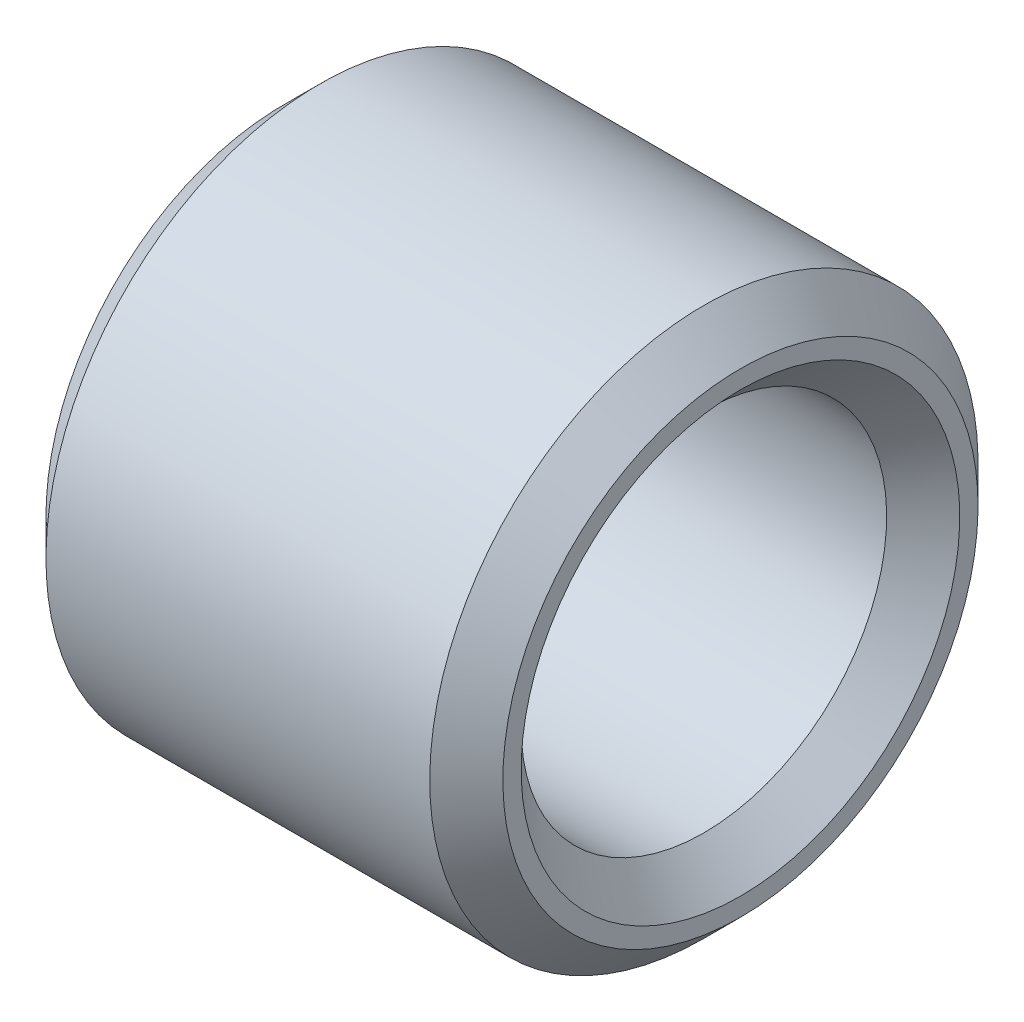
ISO-10303-21;
HEADER;
FILE_DESCRIPTION(('STEP AP214'),'2;1');
FILE_NAME('part.step','',(''),(''),'','','');
FILE_SCHEMA(('AUTOMOTIVE_DESIGN { 1 0 10303 214 1 1 1 1 }'));
ENDSEC;
DATA;
#1=APPLICATION_CONTEXT('core data for automotive mechanical design processes');
#2=APPLICATION_PROTOCOL_DEFINITION('international standard','automotive_design',2000,#1);
#3=PRODUCT_CONTEXT('',#1,'mechanical');
#4=PRODUCT('Part','Part','',(#3));
#5=PRODUCT_RELATED_PRODUCT_CATEGORY('part','',(#4));
#6=PRODUCT_DEFINITION_FORMATION('','',#4);
#7=PRODUCT_DEFINITION_CONTEXT('part definition',#1,'design');
#8=PRODUCT_DEFINITION('design','',#6,#7);
#9=PRODUCT_DEFINITION_SHAPE('','',#8);
#10=(LENGTH_UNIT() NAMED_UNIT(*) SI_UNIT(.MILLI.,.METRE.));
#11=(NAMED_UNIT(*) PLANE_ANGLE_UNIT() SI_UNIT($,.RADIAN.));
#12=(NAMED_UNIT(*) SI_UNIT($,.STERADIAN.) SOLID_ANGLE_UNIT());
#13=UNCERTAINTY_MEASURE_WITH_UNIT(LENGTH_MEASURE(1.E-05),#10,'distance_accuracy_value','');
#14=(GEOMETRIC_REPRESENTATION_CONTEXT(3) GLOBAL_UNCERTAINTY_ASSIGNED_CONTEXT((#13)) GLOBAL_UNIT_ASSIGNED_CONTEXT((#10,
#11,#12)) REPRESENTATION_CONTEXT('',''));
#15=CARTESIAN_POINT('',(0.,0.,0.));
#16=DIRECTION('',(0.,0.,1.));
#17=DIRECTION('',(1.,0.,0.));
#18=AXIS2_PLACEMENT_3D('',#15,#16,#17);
#19=CARTESIAN_POINT('',(0.,-2.5,0.));
#20=DIRECTION('',(-1.,0.,0.));
#21=DIRECTION('',(0.,1.,0.));
#22=AXIS2_PLACEMENT_3D('',#19,#20,#21);
#23=PLANE('',#22);
#24=CARTESIAN_POINT('',(0.,0.,0.));
#25=DIRECTION('',(1.,0.,0.));
#26=DIRECTION('',(0.,-1.,0.));
#27=AXIS2_PLACEMENT_3D('',#24,#25,#26);
#28=CIRCLE('',#27,2.4);
#29=CARTESIAN_POINT('',(0.,-2.4,0.));
#30=VERTEX_POINT('',#29);
#31=EDGE_CURVE('E9',#30,#30,#28,.T.);
#32=ORIENTED_EDGE('',*,*,#31,.T.);
#33=EDGE_LOOP('',(#32));
#34=FACE_BOUND('',#33,.T.);
#35=CARTESIAN_POINT('',(0.,0.,0.));
#36=DIRECTION('',(1.,0.,0.));
#37=DIRECTION('',(0.,-1.,0.));
#38=AXIS2_PLACEMENT_3D('',#35,#36,#37);
#39=CIRCLE('',#38,2.6);
#40=CARTESIAN_POINT('',(0.,-2.6,0.));
#41=VERTEX_POINT('',#40);
#42=EDGE_CURVE('E48',#41,#41,#39,.T.);
#43=ORIENTED_EDGE('',*,*,#42,.F.);
#44=EDGE_LOOP('',(#43));
#45=FACE_BOUND('',#44,.T.);
#46=ADVANCED_FACE('F15',(#34,#45),#23,.T.);
#47=CARTESIAN_POINT('',(0.2,0.,0.));
#48=DIRECTION('',(-1.,0.,0.));
#49=DIRECTION('',(0.,-1.,0.));
#50=AXIS2_PLACEMENT_3D('',#47,#48,#49);
#51=CONICAL_SURFACE('',#50,2.2,0.785398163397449);
#52=CARTESIAN_POINT('',(0.4,0.,0.));
#53=DIRECTION('',(1.,0.,0.));
#54=DIRECTION('',(0.,-1.,0.));
#55=AXIS2_PLACEMENT_3D('',#52,#53,#54);
#56=CIRCLE('',#55,2.);
#57=CARTESIAN_POINT('',(0.4,-2.,0.));
#58=VERTEX_POINT('',#57);
#59=EDGE_CURVE('E25',#58,#58,#56,.T.);
#60=ORIENTED_EDGE('',*,*,#59,.T.);
#61=EDGE_LOOP('',(#60));
#62=FACE_BOUND('',#61,.T.);
#63=ORIENTED_EDGE('',*,*,#31,.F.);
#64=EDGE_LOOP('',(#63));
#65=FACE_BOUND('',#64,.T.);
#66=ADVANCED_FACE('F80',(#62,#65),#51,.F.);
#67=CARTESIAN_POINT('',(2.5,0.,0.));
#68=DIRECTION('',(-1.,0.,0.));
#69=DIRECTION('',(0.,-1.,0.));
#70=AXIS2_PLACEMENT_3D('',#67,#68,#69);
#71=CYLINDRICAL_SURFACE('',#70,2.);
#72=CARTESIAN_POINT('',(4.6,0.,0.));
#73=DIRECTION('',(1.,0.,0.));
#74=DIRECTION('',(0.,-1.,0.));
#75=AXIS2_PLACEMENT_3D('',#72,#73,#74);
#76=CIRCLE('',#75,2.);
#77=CARTESIAN_POINT('',(4.6,-2.,0.));
#78=VERTEX_POINT('',#77);
#79=EDGE_CURVE('E58',#78,#78,#76,.T.);
#80=ORIENTED_EDGE('',*,*,#79,.T.);
#81=EDGE_LOOP('',(#80));
#82=FACE_BOUND('',#81,.T.);
#83=ORIENTED_EDGE('',*,*,#59,.F.);
#84=EDGE_LOOP('',(#83));
#85=FACE_BOUND('',#84,.T.);
#86=ADVANCED_FACE('F65',(#82,#85),#71,.F.);
#87=CARTESIAN_POINT('',(4.8,0.,0.));
#88=DIRECTION('',(1.,0.,0.));
#89=DIRECTION('',(0.,-1.,0.));
#90=AXIS2_PLACEMENT_3D('',#87,#88,#89);
#91=CONICAL_SURFACE('',#90,2.2,0.78539816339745);
#92=CARTESIAN_POINT('',(5.,0.,0.));
#93=DIRECTION('',(1.,0.,0.));
#94=DIRECTION('',(0.,-1.,0.));
#95=AXIS2_PLACEMENT_3D('',#92,#93,#94);
#96=CIRCLE('',#95,2.4);
#97=CARTESIAN_POINT('',(5.,-2.4,0.));
#98=VERTEX_POINT('',#97);
#99=EDGE_CURVE('E59',#98,#98,#96,.T.);
#100=ORIENTED_EDGE('',*,*,#99,.T.);
#101=EDGE_LOOP('',(#100));
#102=FACE_BOUND('',#101,.T.);
#103=ORIENTED_EDGE('',*,*,#79,.F.);
#104=EDGE_LOOP('',(#103));
#105=FACE_BOUND('',#104,.T.);
#106=ADVANCED_FACE('F68',(#102,#105),#91,.F.);
#107=CARTESIAN_POINT('',(5.,-2.5,0.));
#108=DIRECTION('',(1.,0.,0.));
#109=DIRECTION('',(0.,-1.,0.));
#110=AXIS2_PLACEMENT_3D('',#107,#108,#109);
#111=PLANE('',#110);
#112=CARTESIAN_POINT('',(5.,0.,0.));
#113=DIRECTION('',(1.,0.,0.));
#114=DIRECTION('',(0.,-1.,0.));
#115=AXIS2_PLACEMENT_3D('',#112,#113,#114);
#116=CIRCLE('',#115,2.6);
#117=CARTESIAN_POINT('',(5.,-2.6,0.));
#118=VERTEX_POINT('',#117);
#119=EDGE_CURVE('E54',#118,#118,#116,.T.);
#120=ORIENTED_EDGE('',*,*,#119,.T.);
#121=EDGE_LOOP('',(#120));
#122=FACE_BOUND('',#121,.T.);
#123=ORIENTED_EDGE('',*,*,#99,.F.);
#124=EDGE_LOOP('',(#123));
#125=FACE_BOUND('',#124,.T.);
#126=ADVANCED_FACE('F70',(#122,#125),#111,.T.);
#127=CARTESIAN_POINT('',(4.8,0.,0.));
#128=DIRECTION('',(-1.,0.,0.));
#129=DIRECTION('',(0.,-1.,0.));
#130=AXIS2_PLACEMENT_3D('',#127,#128,#129);
#131=CONICAL_SURFACE('',#130,2.8,0.78539816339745);
#132=CARTESIAN_POINT('',(4.6,0.,0.));
#133=DIRECTION('',(1.,0.,0.));
#134=DIRECTION('',(0.,-1.,0.));
#135=AXIS2_PLACEMENT_3D('',#132,#133,#134);
#136=CIRCLE('',#135,3.);
#137=CARTESIAN_POINT('',(4.6,-3.,0.));
#138=VERTEX_POINT('',#137);
#139=EDGE_CURVE('E19',#138,#138,#136,.T.);
#140=ORIENTED_EDGE('',*,*,#139,.T.);
#141=EDGE_LOOP('',(#140));
#142=FACE_BOUND('',#141,.T.);
#143=ORIENTED_EDGE('',*,*,#119,.F.);
#144=EDGE_LOOP('',(#143));
#145=FACE_BOUND('',#144,.T.);
#146=ADVANCED_FACE('F17',(#142,#145),#131,.T.);
#147=CARTESIAN_POINT('',(2.5,0.,0.));
#148=DIRECTION('',(-1.,0.,0.));
#149=DIRECTION('',(0.,-1.,0.));
#150=AXIS2_PLACEMENT_3D('',#147,#148,#149);
#151=CYLINDRICAL_SURFACE('',#150,3.);
#152=CARTESIAN_POINT('',(0.4,0.,0.));
#153=DIRECTION('',(1.,0.,0.));
#154=DIRECTION('',(0.,-1.,0.));
#155=AXIS2_PLACEMENT_3D('',#152,#153,#154);
#156=CIRCLE('',#155,3.);
#157=CARTESIAN_POINT('',(0.4,-3.,0.));
#158=VERTEX_POINT('',#157);
#159=EDGE_CURVE('E52',#158,#158,#156,.T.);
#160=ORIENTED_EDGE('',*,*,#159,.T.);
#161=EDGE_LOOP('',(#160));
#162=FACE_BOUND('',#161,.T.);
#163=ORIENTED_EDGE('',*,*,#139,.F.);
#164=EDGE_LOOP('',(#163));
#165=FACE_BOUND('',#164,.T.);
#166=ADVANCED_FACE('F90',(#162,#165),#151,.T.);
#167=CARTESIAN_POINT('',(0.2,0.,0.));
#168=DIRECTION('',(1.,0.,0.));
#169=DIRECTION('',(0.,-1.,0.));
#170=AXIS2_PLACEMENT_3D('',#167,#168,#169);
#171=CONICAL_SURFACE('',#170,2.8,0.785398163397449);
#172=ORIENTED_EDGE('',*,*,#42,.T.);
#173=EDGE_LOOP('',(#172));
#174=FACE_BOUND('',#173,.T.);
#175=ORIENTED_EDGE('',*,*,#159,.F.);
#176=EDGE_LOOP('',(#175));
#177=FACE_BOUND('',#176,.T.);
#178=ADVANCED_FACE('F49',(#174,#177),#171,.T.);
#179=CLOSED_SHELL('',(#46,#66,#86,#106,#126,#146,#166,#178));
#180=MANIFOLD_SOLID_BREP('B1',#179);
#181=ADVANCED_BREP_SHAPE_REPRESENTATION('',(#18,#180),#14);
#182=SHAPE_DEFINITION_REPRESENTATION(#9,#181);
ENDSEC;
END-ISO-10303-21;
